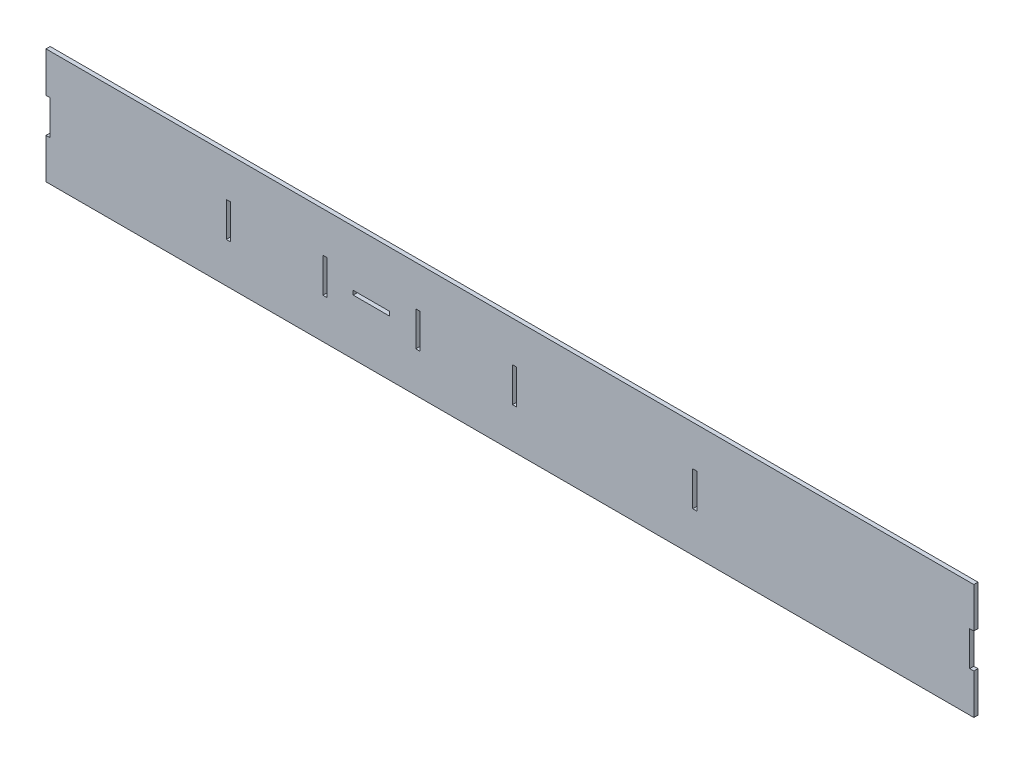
from build123d import *

# Parameters (mm, degrees)
SKETCH1_W           = 1.524
SKETCH1_H           = 12.7
BOSS_EXTRUDE1_DEPTH = 1.524
SKETCH2_W           = 1.524
SKETCH2_H           = 12.7
SKETCH2_W_2         = 13.405838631
SKETCH2_H_2         = 1.524
CUT_EXTRUDE1_DEPTH  = 2.54


with BuildPart() as part:
    # Sketch1 → Boss-Extrude1 (new body)
    with BuildSketch(Plane.XY):
        Polygon((0, -7.868951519), (-1.524, -7.868951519), (-1.524, -22.644636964), (338.849599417, -22.644636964), (338.849599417, -7.868951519), (337.325599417, -7.868951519), (337.325599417, 4.831048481), (338.849599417, 4.831048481), (338.849599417, 19.606733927), (-1.524, 19.606733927), (-1.524, 4.831048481), (0, 4.831048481), align=None)
        with Locations((100.838, -1.518951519)):
            Rectangle(SKETCH1_W, SKETCH1_H, mode=Mode.SUBTRACT)
        with Locations((134.887599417, -1.518951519)):
            Rectangle(SKETCH1_W, SKETCH1_H, mode=Mode.SUBTRACT)
        with Locations((236.487599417, -1.518951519)):
            Rectangle(SKETCH1_W, SKETCH1_H, mode=Mode.SUBTRACT)
    extrude(amount=BOSS_EXTRUDE1_DEPTH)

    # Sketch2 → Cut-Extrude1 (cut)
    with BuildSketch(Plane.XY.offset(1.524)):
        with Locations((65.366149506, -1.518951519)):
            Rectangle(SKETCH2_W, SKETCH2_H)
        with Locations((170.359449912, -1.518951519)):
            Rectangle(SKETCH2_W, SKETCH2_H)
        with Locations((117.862799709, -1.518951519)):
            Rectangle(SKETCH2_W_2, SKETCH2_H_2)
    extrude(amount=-CUT_EXTRUDE1_DEPTH, mode=Mode.SUBTRACT)


solid = part.part
